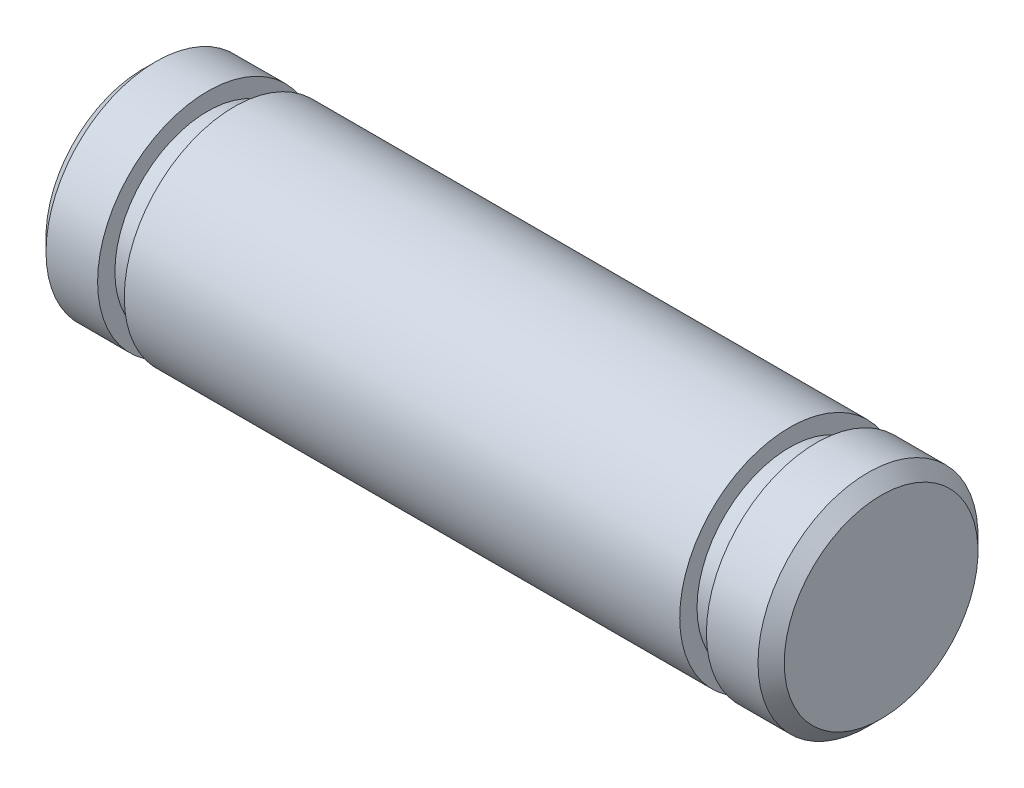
ISO-10303-21;
HEADER;
FILE_DESCRIPTION(('STEP AP214'),'2;1');
FILE_NAME('part.step','',(''),(''),'','','');
FILE_SCHEMA(('AUTOMOTIVE_DESIGN { 1 0 10303 214 1 1 1 1 }'));
ENDSEC;
DATA;
#1=APPLICATION_CONTEXT('core data for automotive mechanical design processes');
#2=APPLICATION_PROTOCOL_DEFINITION('international standard','automotive_design',2000,#1);
#3=PRODUCT_CONTEXT('',#1,'mechanical');
#4=PRODUCT('Part','Part','',(#3));
#5=PRODUCT_RELATED_PRODUCT_CATEGORY('part','',(#4));
#6=PRODUCT_DEFINITION_FORMATION('','',#4);
#7=PRODUCT_DEFINITION_CONTEXT('part definition',#1,'design');
#8=PRODUCT_DEFINITION('design','',#6,#7);
#9=PRODUCT_DEFINITION_SHAPE('','',#8);
#10=(LENGTH_UNIT() NAMED_UNIT(*) SI_UNIT(.MILLI.,.METRE.));
#11=(NAMED_UNIT(*) PLANE_ANGLE_UNIT() SI_UNIT($,.RADIAN.));
#12=(NAMED_UNIT(*) SI_UNIT($,.STERADIAN.) SOLID_ANGLE_UNIT());
#13=UNCERTAINTY_MEASURE_WITH_UNIT(LENGTH_MEASURE(1.E-05),#10,'distance_accuracy_value','');
#14=(GEOMETRIC_REPRESENTATION_CONTEXT(3) GLOBAL_UNCERTAINTY_ASSIGNED_CONTEXT((#13)) GLOBAL_UNIT_ASSIGNED_CONTEXT((#10,
#11,#12)) REPRESENTATION_CONTEXT('',''));
#15=CARTESIAN_POINT('',(0.,0.,0.));
#16=DIRECTION('',(0.,0.,1.));
#17=DIRECTION('',(1.,0.,0.));
#18=AXIS2_PLACEMENT_3D('',#15,#16,#17);
#19=CARTESIAN_POINT('',(21.4376,2.81305,0.));
#20=DIRECTION('',(-1.,0.,0.));
#21=DIRECTION('',(0.,0.,1.));
#22=AXIS2_PLACEMENT_3D('',#19,#20,#21);
#23=PLANE('',#22);
#24=CARTESIAN_POINT('',(21.4375999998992,0.,0.));
#25=DIRECTION('',(-1.,0.,0.));
#26=DIRECTION('',(0.,0.,1.));
#27=AXIS2_PLACEMENT_3D('',#24,#25,#26);
#28=CIRCLE('',#27,2.81305000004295);
#29=CARTESIAN_POINT('',(21.4375999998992,0.,2.81305000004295));
#30=VERTEX_POINT('',#29);
#31=EDGE_CURVE('E17',#30,#30,#28,.T.);
#32=ORIENTED_EDGE('',*,*,#31,.F.);
#33=EDGE_LOOP('',(#32));
#34=FACE_BOUND('',#33,.T.);
#35=ADVANCED_FACE('F14',(#34),#23,.F.);
#36=CARTESIAN_POINT('',(0.,0.,0.));
#37=DIRECTION('',(1.,0.,0.));
#38=DIRECTION('',(0.,0.,-1.));
#39=AXIS2_PLACEMENT_3D('',#36,#37,#38);
#40=PLANE('',#39);
#41=CARTESIAN_POINT('',(5.6843418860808E-11,0.,0.));
#42=DIRECTION('',(1.,0.,0.));
#43=DIRECTION('',(0.,0.,-1.));
#44=AXIS2_PLACEMENT_3D('',#41,#42,#43);
#45=CIRCLE('',#44,2.81304999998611);
#46=CARTESIAN_POINT('',(5.6843418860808E-11,0.,-2.81304999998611));
#47=VERTEX_POINT('',#46);
#48=EDGE_CURVE('E49',#47,#47,#45,.T.);
#49=ORIENTED_EDGE('',*,*,#48,.F.);
#50=EDGE_LOOP('',(#49));
#51=FACE_BOUND('',#50,.T.);
#52=ADVANCED_FACE('F61',(#51),#40,.F.);
#53=CARTESIAN_POINT('',(21.0566000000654,0.,0.));
#54=DIRECTION('',(-1.,0.,0.));
#55=DIRECTION('',(0.,0.,1.));
#56=AXIS2_PLACEMENT_3D('',#53,#54,#55);
#57=CONICAL_SURFACE('',#56,3.19404999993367,0.785398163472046);
#58=CARTESIAN_POINT('',(21.0566,0.,0.));
#59=DIRECTION('',(-1.,0.,0.));
#60=DIRECTION('',(0.,0.,1.));
#61=AXIS2_PLACEMENT_3D('',#58,#59,#60);
#62=CIRCLE('',#61,3.19405);
#63=CARTESIAN_POINT('',(21.0566,0.,3.19405));
#64=VERTEX_POINT('',#63);
#65=EDGE_CURVE('E51',#64,#64,#62,.T.);
#66=ORIENTED_EDGE('',*,*,#65,.F.);
#67=EDGE_LOOP('',(#66));
#68=FACE_BOUND('',#67,.T.);
#69=ORIENTED_EDGE('',*,*,#31,.T.);
#70=EDGE_LOOP('',(#69));
#71=FACE_BOUND('',#70,.T.);
#72=ADVANCED_FACE('F58',(#68,#71),#57,.T.);
#73=CARTESIAN_POINT('',(0.381000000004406,0.,0.));
#74=DIRECTION('',(1.,0.,0.));
#75=DIRECTION('',(0.,0.,-1.));
#76=AXIS2_PLACEMENT_3D('',#73,#74,#75);
#77=CONICAL_SURFACE('',#76,3.19404999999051,0.785398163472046);
#78=ORIENTED_EDGE('',*,*,#48,.T.);
#79=EDGE_LOOP('',(#78));
#80=FACE_BOUND('',#79,.T.);
#81=CARTESIAN_POINT('',(0.380999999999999,0.,0.));
#82=DIRECTION('',(-1.,0.,0.));
#83=DIRECTION('',(0.,0.,1.));
#84=AXIS2_PLACEMENT_3D('',#81,#82,#83);
#85=CIRCLE('',#84,3.19405);
#86=CARTESIAN_POINT('',(0.380999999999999,0.,3.19405));
#87=VERTEX_POINT('',#86);
#88=EDGE_CURVE('E48',#87,#87,#85,.F.);
#89=ORIENTED_EDGE('',*,*,#88,.F.);
#90=EDGE_LOOP('',(#89));
#91=FACE_BOUND('',#90,.T.);
#92=ADVANCED_FACE('F105',(#80,#91),#77,.T.);
#93=CARTESIAN_POINT('',(21.4376,0.,0.));
#94=DIRECTION('',(-1.,0.,0.));
#95=DIRECTION('',(0.,0.,1.));
#96=AXIS2_PLACEMENT_3D('',#93,#94,#95);
#97=CYLINDRICAL_SURFACE('',#96,3.19405);
#98=CARTESIAN_POINT('',(19.558,0.,0.));
#99=DIRECTION('',(-1.,0.,0.));
#100=DIRECTION('',(0.,0.,1.));
#101=AXIS2_PLACEMENT_3D('',#98,#99,#100);
#102=CIRCLE('',#101,3.19405);
#103=CARTESIAN_POINT('',(19.558,0.,3.19405));
#104=VERTEX_POINT('',#103);
#105=EDGE_CURVE('E46',#104,#104,#102,.F.);
#106=ORIENTED_EDGE('',*,*,#105,.T.);
#107=EDGE_LOOP('',(#106));
#108=FACE_BOUND('',#107,.T.);
#109=ORIENTED_EDGE('',*,*,#65,.T.);
#110=EDGE_LOOP('',(#109));
#111=FACE_BOUND('',#110,.T.);
#112=ADVANCED_FACE('F101',(#108,#111),#97,.T.);
#113=CARTESIAN_POINT('',(21.4376,0.,0.));
#114=DIRECTION('',(-1.,0.,0.));
#115=DIRECTION('',(0.,0.,1.));
#116=AXIS2_PLACEMENT_3D('',#113,#114,#115);
#117=CYLINDRICAL_SURFACE('',#116,3.19405);
#118=ORIENTED_EDGE('',*,*,#88,.T.);
#119=EDGE_LOOP('',(#118));
#120=FACE_BOUND('',#119,.T.);
#121=CARTESIAN_POINT('',(1.8796,0.,0.));
#122=DIRECTION('',(-1.,0.,0.));
#123=DIRECTION('',(0.,0.,1.));
#124=AXIS2_PLACEMENT_3D('',#121,#122,#123);
#125=CIRCLE('',#124,3.19405);
#126=CARTESIAN_POINT('',(1.8796,0.,3.19405));
#127=VERTEX_POINT('',#126);
#128=EDGE_CURVE('E43',#127,#127,#125,.T.);
#129=ORIENTED_EDGE('',*,*,#128,.T.);
#130=EDGE_LOOP('',(#129));
#131=FACE_BOUND('',#130,.T.);
#132=ADVANCED_FACE('F97',(#120,#131),#117,.T.);
#133=CARTESIAN_POINT('',(19.558,2.6924,0.));
#134=DIRECTION('',(1.,0.,0.));
#135=DIRECTION('',(0.,0.,-1.));
#136=AXIS2_PLACEMENT_3D('',#133,#134,#135);
#137=PLANE('',#136);
#138=CARTESIAN_POINT('',(19.558,0.,0.));
#139=DIRECTION('',(-1.,0.,0.));
#140=DIRECTION('',(0.,0.,1.));
#141=AXIS2_PLACEMENT_3D('',#138,#139,#140);
#142=CIRCLE('',#141,2.6924);
#143=CARTESIAN_POINT('',(19.558,0.,2.6924));
#144=VERTEX_POINT('',#143);
#145=EDGE_CURVE('E40',#144,#144,#142,.T.);
#146=ORIENTED_EDGE('',*,*,#145,.F.);
#147=EDGE_LOOP('',(#146));
#148=FACE_BOUND('',#147,.T.);
#149=ORIENTED_EDGE('',*,*,#105,.F.);
#150=EDGE_LOOP('',(#149));
#151=FACE_BOUND('',#150,.T.);
#152=ADVANCED_FACE('F93',(#148,#151),#137,.F.);
#153=CARTESIAN_POINT('',(1.8796,3.19405,0.));
#154=DIRECTION('',(-1.,0.,0.));
#155=DIRECTION('',(0.,0.,1.));
#156=AXIS2_PLACEMENT_3D('',#153,#154,#155);
#157=PLANE('',#156);
#158=ORIENTED_EDGE('',*,*,#128,.F.);
#159=EDGE_LOOP('',(#158));
#160=FACE_BOUND('',#159,.T.);
#161=CARTESIAN_POINT('',(1.8796,0.,0.));
#162=DIRECTION('',(-1.,0.,0.));
#163=DIRECTION('',(0.,0.,1.));
#164=AXIS2_PLACEMENT_3D('',#161,#162,#163);
#165=CIRCLE('',#164,2.6924);
#166=CARTESIAN_POINT('',(1.8796,0.,2.6924));
#167=VERTEX_POINT('',#166);
#168=EDGE_CURVE('E37',#167,#167,#165,.F.);
#169=ORIENTED_EDGE('',*,*,#168,.F.);
#170=EDGE_LOOP('',(#169));
#171=FACE_BOUND('',#170,.T.);
#172=ADVANCED_FACE('F89',(#160,#171),#157,.F.);
#173=CARTESIAN_POINT('',(21.4376,0.,0.));
#174=DIRECTION('',(-1.,0.,0.));
#175=DIRECTION('',(0.,0.,1.));
#176=AXIS2_PLACEMENT_3D('',#173,#174,#175);
#177=CYLINDRICAL_SURFACE('',#176,2.6924);
#178=CARTESIAN_POINT('',(18.7833,0.,0.));
#179=DIRECTION('',(-1.,0.,0.));
#180=DIRECTION('',(0.,0.,1.));
#181=AXIS2_PLACEMENT_3D('',#178,#179,#180);
#182=CIRCLE('',#181,2.6924);
#183=CARTESIAN_POINT('',(18.7833,0.,2.6924));
#184=VERTEX_POINT('',#183);
#185=EDGE_CURVE('E34',#184,#184,#182,.F.);
#186=ORIENTED_EDGE('',*,*,#185,.T.);
#187=EDGE_LOOP('',(#186));
#188=FACE_BOUND('',#187,.T.);
#189=ORIENTED_EDGE('',*,*,#145,.T.);
#190=EDGE_LOOP('',(#189));
#191=FACE_BOUND('',#190,.T.);
#192=ADVANCED_FACE('F85',(#188,#191),#177,.T.);
#193=CARTESIAN_POINT('',(21.4376,0.,0.));
#194=DIRECTION('',(-1.,0.,0.));
#195=DIRECTION('',(0.,0.,1.));
#196=AXIS2_PLACEMENT_3D('',#193,#194,#195);
#197=CYLINDRICAL_SURFACE('',#196,2.6924);
#198=ORIENTED_EDGE('',*,*,#168,.T.);
#199=EDGE_LOOP('',(#198));
#200=FACE_BOUND('',#199,.T.);
#201=CARTESIAN_POINT('',(2.6543,0.,0.));
#202=DIRECTION('',(-1.,0.,0.));
#203=DIRECTION('',(0.,0.,1.));
#204=AXIS2_PLACEMENT_3D('',#201,#202,#203);
#205=CIRCLE('',#204,2.6924);
#206=CARTESIAN_POINT('',(2.6543,0.,2.6924));
#207=VERTEX_POINT('',#206);
#208=EDGE_CURVE('E26',#207,#207,#205,.T.);
#209=ORIENTED_EDGE('',*,*,#208,.T.);
#210=EDGE_LOOP('',(#209));
#211=FACE_BOUND('',#210,.T.);
#212=ADVANCED_FACE('F81',(#200,#211),#197,.T.);
#213=CARTESIAN_POINT('',(18.7833,3.19405,0.));
#214=DIRECTION('',(-1.,0.,0.));
#215=DIRECTION('',(0.,0.,1.));
#216=AXIS2_PLACEMENT_3D('',#213,#214,#215);
#217=PLANE('',#216);
#218=CARTESIAN_POINT('',(18.7833,0.,0.));
#219=DIRECTION('',(-1.,0.,0.));
#220=DIRECTION('',(0.,0.,1.));
#221=AXIS2_PLACEMENT_3D('',#218,#219,#220);
#222=CIRCLE('',#221,3.19405);
#223=CARTESIAN_POINT('',(18.7833,0.,3.19405));
#224=VERTEX_POINT('',#223);
#225=EDGE_CURVE('E21',#224,#224,#222,.T.);
#226=ORIENTED_EDGE('',*,*,#225,.F.);
#227=EDGE_LOOP('',(#226));
#228=FACE_BOUND('',#227,.T.);
#229=ORIENTED_EDGE('',*,*,#185,.F.);
#230=EDGE_LOOP('',(#229));
#231=FACE_BOUND('',#230,.T.);
#232=ADVANCED_FACE('F74',(#228,#231),#217,.F.);
#233=CARTESIAN_POINT('',(2.6543,2.6924,0.));
#234=DIRECTION('',(1.,0.,0.));
#235=DIRECTION('',(0.,0.,-1.));
#236=AXIS2_PLACEMENT_3D('',#233,#234,#235);
#237=PLANE('',#236);
#238=ORIENTED_EDGE('',*,*,#208,.F.);
#239=EDGE_LOOP('',(#238));
#240=FACE_BOUND('',#239,.T.);
#241=CARTESIAN_POINT('',(2.6543,0.,0.));
#242=DIRECTION('',(-1.,0.,0.));
#243=DIRECTION('',(0.,0.,1.));
#244=AXIS2_PLACEMENT_3D('',#241,#242,#243);
#245=CIRCLE('',#244,3.19405);
#246=CARTESIAN_POINT('',(2.6543,0.,3.19405));
#247=VERTEX_POINT('',#246);
#248=EDGE_CURVE('E10',#247,#247,#245,.F.);
#249=ORIENTED_EDGE('',*,*,#248,.F.);
#250=EDGE_LOOP('',(#249));
#251=FACE_BOUND('',#250,.T.);
#252=ADVANCED_FACE('F69',(#240,#251),#237,.F.);
#253=CARTESIAN_POINT('',(21.4376,0.,0.));
#254=DIRECTION('',(-1.,0.,0.));
#255=DIRECTION('',(0.,0.,1.));
#256=AXIS2_PLACEMENT_3D('',#253,#254,#255);
#257=CYLINDRICAL_SURFACE('',#256,3.19405);
#258=ORIENTED_EDGE('',*,*,#248,.T.);
#259=EDGE_LOOP('',(#258));
#260=FACE_BOUND('',#259,.T.);
#261=ORIENTED_EDGE('',*,*,#225,.T.);
#262=EDGE_LOOP('',(#261));
#263=FACE_BOUND('',#262,.T.);
#264=ADVANCED_FACE('F67',(#260,#263),#257,.T.);
#265=CLOSED_SHELL('',(#35,#52,#72,#92,#112,#132,#152,#172,#192,#212,#232,#252,#264));
#266=MANIFOLD_SOLID_BREP('B1',#265);
#267=ADVANCED_BREP_SHAPE_REPRESENTATION('',(#18,#266),#14);
#268=SHAPE_DEFINITION_REPRESENTATION(#9,#267);
ENDSEC;
END-ISO-10303-21;
